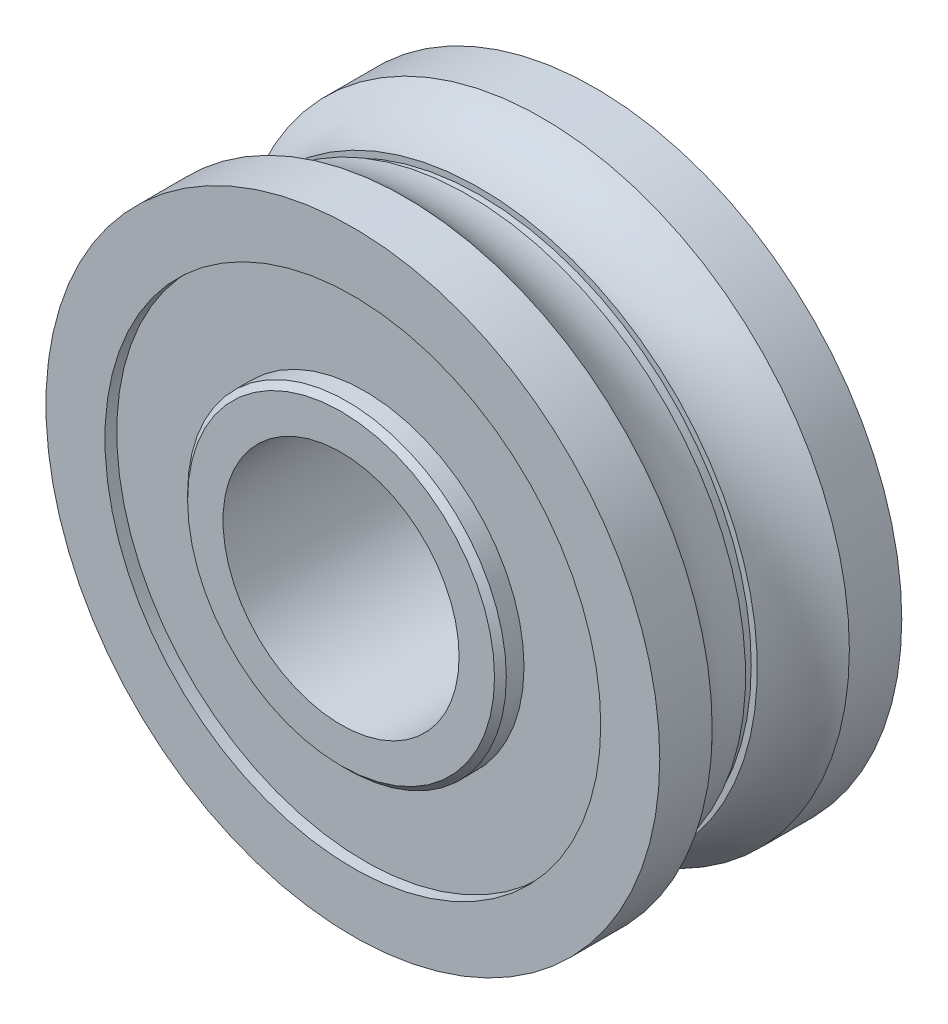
ISO-10303-21;
HEADER;
FILE_DESCRIPTION(('STEP AP214'),'2;1');
FILE_NAME('part.step','',(''),(''),'','','');
FILE_SCHEMA(('AUTOMOTIVE_DESIGN { 1 0 10303 214 1 1 1 1 }'));
ENDSEC;
DATA;
#1=APPLICATION_CONTEXT('core data for automotive mechanical design processes');
#2=APPLICATION_PROTOCOL_DEFINITION('international standard','automotive_design',2000,#1);
#3=PRODUCT_CONTEXT('',#1,'mechanical');
#4=PRODUCT('Part','Part','',(#3));
#5=PRODUCT_RELATED_PRODUCT_CATEGORY('part','',(#4));
#6=PRODUCT_DEFINITION_FORMATION('','',#4);
#7=PRODUCT_DEFINITION_CONTEXT('part definition',#1,'design');
#8=PRODUCT_DEFINITION('design','',#6,#7);
#9=PRODUCT_DEFINITION_SHAPE('','',#8);
#10=(LENGTH_UNIT() NAMED_UNIT(*) SI_UNIT(.MILLI.,.METRE.));
#11=(NAMED_UNIT(*) PLANE_ANGLE_UNIT() SI_UNIT($,.RADIAN.));
#12=(NAMED_UNIT(*) SI_UNIT($,.STERADIAN.) SOLID_ANGLE_UNIT());
#13=UNCERTAINTY_MEASURE_WITH_UNIT(LENGTH_MEASURE(1.E-05),#10,'distance_accuracy_value','');
#14=(GEOMETRIC_REPRESENTATION_CONTEXT(3) GLOBAL_UNCERTAINTY_ASSIGNED_CONTEXT((#13)) GLOBAL_UNIT_ASSIGNED_CONTEXT((#10,
#11,#12)) REPRESENTATION_CONTEXT('',''));
#15=CARTESIAN_POINT('',(0.,0.,0.));
#16=DIRECTION('',(0.,0.,1.));
#17=DIRECTION('',(1.,0.,0.));
#18=AXIS2_PLACEMENT_3D('',#15,#16,#17);
#19=CARTESIAN_POINT('',(-3.410605E-13,0.,-11.75));
#20=DIRECTION('',(0.,0.,1.));
#21=DIRECTION('',(1.,0.,0.));
#22=AXIS2_PLACEMENT_3D('',#19,#20,#21);
#23=CYLINDRICAL_SURFACE('',#22,23.);
#24=CARTESIAN_POINT('',(-3.41060500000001E-13,0.,-11.75));
#25=DIRECTION('',(0.,0.,1.));
#26=DIRECTION('',(1.,0.,0.));
#27=AXIS2_PLACEMENT_3D('',#24,#25,#26);
#28=CIRCLE('',#27,23.);
#29=CARTESIAN_POINT('',(22.9999999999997,0.,-11.7500000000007));
#30=VERTEX_POINT('',#29);
#31=EDGE_CURVE('E69',#30,#30,#28,.F.);
#32=ORIENTED_EDGE('',*,*,#31,.F.);
#33=EDGE_LOOP('',(#32));
#34=FACE_BOUND('',#33,.T.);
#35=CARTESIAN_POINT('',(-3.09656670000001E-13,0.,-10.75));
#36=DIRECTION('',(0.,0.,1.));
#37=DIRECTION('',(1.,0.,0.));
#38=AXIS2_PLACEMENT_3D('',#35,#36,#37);
#39=CIRCLE('',#38,23.);
#40=CARTESIAN_POINT('',(22.9999999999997,0.,-10.7500000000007));
#41=VERTEX_POINT('',#40);
#42=EDGE_CURVE('E16',#41,#41,#39,.F.);
#43=ORIENTED_EDGE('',*,*,#42,.T.);
#44=EDGE_LOOP('',(#43));
#45=FACE_BOUND('',#44,.T.);
#46=ADVANCED_FACE('F13',(#34,#45),#23,.T.);
#47=CARTESIAN_POINT('',(-3.410605E-13,0.,-10.75));
#48=DIRECTION('',(0.,0.,1.));
#49=DIRECTION('',(1.,0.,0.));
#50=AXIS2_PLACEMENT_3D('',#47,#48,#49);
#51=PLANE('',#50);
#52=ORIENTED_EDGE('',*,*,#42,.F.);
#53=EDGE_LOOP('',(#52));
#54=FACE_BOUND('',#53,.T.);
#55=CARTESIAN_POINT('',(-3.25358584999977E-13,0.,-10.7499999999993));
#56=DIRECTION('',(0.,0.,-1.));
#57=DIRECTION('',(-1.,0.,0.));
#58=AXIS2_PLACEMENT_3D('',#55,#56,#57);
#59=CIRCLE('',#58,23.5156402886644);
#60=CARTESIAN_POINT('',(-23.5156402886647,0.,-10.7499999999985));
#61=VERTEX_POINT('',#60);
#62=EDGE_CURVE('E67',#61,#61,#59,.T.);
#63=ORIENTED_EDGE('',*,*,#62,.T.);
#64=EDGE_LOOP('',(#63));
#65=FACE_BOUND('',#64,.T.);
#66=ADVANCED_FACE('F77',(#54,#65),#51,.F.);
#67=CARTESIAN_POINT('',(-3.410605E-13,0.,-11.75));
#68=DIRECTION('',(0.,0.,1.));
#69=DIRECTION('',(1.,0.,0.));
#70=AXIS2_PLACEMENT_3D('',#67,#68,#69);
#71=PLANE('',#70);
#72=ORIENTED_EDGE('',*,*,#31,.T.);
#73=EDGE_LOOP('',(#72));
#74=FACE_BOUND('',#73,.T.);
#75=CARTESIAN_POINT('',(-3.56762414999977E-13,0.,-11.7499999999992));
#76=DIRECTION('',(0.,0.,-1.));
#77=DIRECTION('',(-1.,0.,0.));
#78=AXIS2_PLACEMENT_3D('',#75,#76,#77);
#79=CIRCLE('',#78,23.5156402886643);
#80=CARTESIAN_POINT('',(-23.5156402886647,0.,-11.7499999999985));
#81=VERTEX_POINT('',#80);
#82=EDGE_CURVE('E63',#81,#81,#79,.F.);
#83=ORIENTED_EDGE('',*,*,#82,.T.);
#84=EDGE_LOOP('',(#83));
#85=FACE_BOUND('',#84,.T.);
#86=ADVANCED_FACE('F80',(#74,#85),#71,.T.);
#87=CARTESIAN_POINT('',(-3.410605E-13,0.,-11.25));
#88=DIRECTION('',(0.,0.,-1.));
#89=DIRECTION('',(-1.,0.,0.));
#90=AXIS2_PLACEMENT_3D('',#87,#88,#89);
#91=TOROIDAL_SURFACE('',#90,31.5,8.);
#92=CARTESIAN_POINT('',(-1.77791976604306E-13,0.,-5.44052498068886));
#93=DIRECTION('',(0.,0.,1.));
#94=DIRECTION('',(1.,0.,0.));
#95=AXIS2_PLACEMENT_3D('',#92,#93,#94);
#96=CIRCLE('',#95,26.);
#97=CARTESIAN_POINT('',(25.9999999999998,0.,-5.44052498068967));
#98=VERTEX_POINT('',#97);
#99=EDGE_CURVE('E66',#98,#98,#96,.T.);
#100=ORIENTED_EDGE('',*,*,#99,.F.);
#101=EDGE_LOOP('',(#100));
#102=FACE_BOUND('',#101,.T.);
#103=ORIENTED_EDGE('',*,*,#62,.F.);
#104=EDGE_LOOP('',(#103));
#105=FACE_BOUND('',#104,.T.);
#106=ADVANCED_FACE('F83',(#102,#105),#91,.F.);
#107=CARTESIAN_POINT('',(-3.410605E-13,0.,-11.25));
#108=DIRECTION('',(0.,0.,-1.));
#109=DIRECTION('',(-1.,0.,0.));
#110=AXIS2_PLACEMENT_3D('',#107,#108,#109);
#111=TOROIDAL_SURFACE('',#110,31.5,8.);
#112=ORIENTED_EDGE('',*,*,#82,.F.);
#113=EDGE_LOOP('',(#112));
#114=FACE_BOUND('',#113,.T.);
#115=CARTESIAN_POINT('',(-5.42671508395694E-13,0.,-17.0594750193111));
#116=DIRECTION('',(0.,0.,1.));
#117=DIRECTION('',(1.,0.,0.));
#118=AXIS2_PLACEMENT_3D('',#115,#116,#117);
#119=CIRCLE('',#118,26.);
#120=CARTESIAN_POINT('',(25.9999999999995,0.,-17.0594750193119));
#121=VERTEX_POINT('',#120);
#122=EDGE_CURVE('E62',#121,#121,#119,.F.);
#123=ORIENTED_EDGE('',*,*,#122,.F.);
#124=EDGE_LOOP('',(#123));
#125=FACE_BOUND('',#124,.T.);
#126=ADVANCED_FACE('F85',(#114,#125),#111,.F.);
#127=CARTESIAN_POINT('',(-6.82121E-13,0.,-21.5));
#128=DIRECTION('',(0.,0.,1.));
#129=DIRECTION('',(1.,0.,0.));
#130=AXIS2_PLACEMENT_3D('',#127,#128,#129);
#131=CYLINDRICAL_SURFACE('',#130,26.);
#132=ORIENTED_EDGE('',*,*,#99,.T.);
#133=EDGE_LOOP('',(#132));
#134=FACE_BOUND('',#133,.T.);
#135=CARTESIAN_POINT('',(0.,0.,-0.999999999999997));
#136=DIRECTION('',(0.,0.,1.));
#137=DIRECTION('',(1.,0.,0.));
#138=AXIS2_PLACEMENT_3D('',#135,#136,#137);
#139=CIRCLE('',#138,26.);
#140=CARTESIAN_POINT('',(26.,0.,-1.00000000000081));
#141=VERTEX_POINT('',#140);
#142=EDGE_CURVE('E59',#141,#141,#139,.T.);
#143=ORIENTED_EDGE('',*,*,#142,.F.);
#144=EDGE_LOOP('',(#143));
#145=FACE_BOUND('',#144,.T.);
#146=ADVANCED_FACE('F93',(#134,#145),#131,.T.);
#147=CARTESIAN_POINT('',(-6.82121E-13,0.,-21.5));
#148=DIRECTION('',(0.,0.,1.));
#149=DIRECTION('',(1.,0.,0.));
#150=AXIS2_PLACEMENT_3D('',#147,#148,#149);
#151=CYLINDRICAL_SURFACE('',#150,26.);
#152=ORIENTED_EDGE('',*,*,#122,.T.);
#153=EDGE_LOOP('',(#152));
#154=FACE_BOUND('',#153,.T.);
#155=CARTESIAN_POINT('',(-6.82121E-13,0.,-21.5));
#156=DIRECTION('',(0.,0.,1.));
#157=DIRECTION('',(1.,0.,0.));
#158=AXIS2_PLACEMENT_3D('',#155,#156,#157);
#159=CIRCLE('',#158,26.);
#160=CARTESIAN_POINT('',(25.9999999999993,0.,-21.5000000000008));
#161=VERTEX_POINT('',#160);
#162=EDGE_CURVE('E56',#161,#161,#159,.T.);
#163=ORIENTED_EDGE('',*,*,#162,.T.);
#164=EDGE_LOOP('',(#163));
#165=FACE_BOUND('',#164,.T.);
#166=ADVANCED_FACE('F152',(#154,#165),#151,.T.);
#167=CARTESIAN_POINT('',(0.,0.,-1.));
#168=DIRECTION('',(0.,0.,1.));
#169=DIRECTION('',(1.,0.,0.));
#170=AXIS2_PLACEMENT_3D('',#167,#168,#169);
#171=PLANE('',#170);
#172=CARTESIAN_POINT('',(0.,0.,-0.999999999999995));
#173=DIRECTION('',(0.,0.,1.));
#174=DIRECTION('',(1.,0.,0.));
#175=AXIS2_PLACEMENT_3D('',#172,#173,#174);
#176=CIRCLE('',#175,21.);
#177=CARTESIAN_POINT('',(20.9999999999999,0.,-1.00000000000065));
#178=VERTEX_POINT('',#177);
#179=EDGE_CURVE('E53',#178,#178,#176,.F.);
#180=ORIENTED_EDGE('',*,*,#179,.T.);
#181=EDGE_LOOP('',(#180));
#182=FACE_BOUND('',#181,.T.);
#183=ORIENTED_EDGE('',*,*,#142,.T.);
#184=EDGE_LOOP('',(#183));
#185=FACE_BOUND('',#184,.T.);
#186=ADVANCED_FACE('F148',(#182,#185),#171,.T.);
#187=CARTESIAN_POINT('',(-6.82121E-13,0.,-21.5));
#188=DIRECTION('',(0.,0.,1.));
#189=DIRECTION('',(1.,0.,0.));
#190=AXIS2_PLACEMENT_3D('',#187,#188,#189);
#191=PLANE('',#190);
#192=CARTESIAN_POINT('',(-6.82121E-13,0.,-21.5));
#193=DIRECTION('',(0.,0.,1.));
#194=DIRECTION('',(1.,0.,0.));
#195=AXIS2_PLACEMENT_3D('',#192,#193,#194);
#196=CIRCLE('',#195,21.);
#197=CARTESIAN_POINT('',(20.9999999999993,0.,-21.5000000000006));
#198=VERTEX_POINT('',#197);
#199=EDGE_CURVE('E50',#198,#198,#196,.T.);
#200=ORIENTED_EDGE('',*,*,#199,.T.);
#201=EDGE_LOOP('',(#200));
#202=FACE_BOUND('',#201,.T.);
#203=ORIENTED_EDGE('',*,*,#162,.F.);
#204=EDGE_LOOP('',(#203));
#205=FACE_BOUND('',#204,.T.);
#206=ADVANCED_FACE('F144',(#202,#205),#191,.F.);
#207=CARTESIAN_POINT('',(-1.136868E-13,0.,-1.99999999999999));
#208=DIRECTION('',(0.,0.,1.));
#209=DIRECTION('',(1.,0.,0.));
#210=AXIS2_PLACEMENT_3D('',#207,#208,#209);
#211=CYLINDRICAL_SURFACE('',#210,21.);
#212=CARTESIAN_POINT('',(-1.136868E-13,0.,-1.99999999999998));
#213=DIRECTION('',(0.,0.,1.));
#214=DIRECTION('',(1.,0.,0.));
#215=AXIS2_PLACEMENT_3D('',#212,#213,#214);
#216=CIRCLE('',#215,21.);
#217=CARTESIAN_POINT('',(20.9999999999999,0.,-2.00000000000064));
#218=VERTEX_POINT('',#217);
#219=EDGE_CURVE('E47',#218,#218,#216,.T.);
#220=ORIENTED_EDGE('',*,*,#219,.F.);
#221=EDGE_LOOP('',(#220));
#222=FACE_BOUND('',#221,.T.);
#223=ORIENTED_EDGE('',*,*,#179,.F.);
#224=EDGE_LOOP('',(#223));
#225=FACE_BOUND('',#224,.T.);
#226=ADVANCED_FACE('F140',(#222,#225),#211,.F.);
#227=CARTESIAN_POINT('',(-6.82121E-13,0.,-21.5));
#228=DIRECTION('',(0.,0.,1.));
#229=DIRECTION('',(1.,0.,0.));
#230=AXIS2_PLACEMENT_3D('',#227,#228,#229);
#231=CYLINDRICAL_SURFACE('',#230,21.);
#232=ORIENTED_EDGE('',*,*,#199,.F.);
#233=EDGE_LOOP('',(#232));
#234=FACE_BOUND('',#233,.T.);
#235=CARTESIAN_POINT('',(-6.5071717E-13,0.,-20.5));
#236=DIRECTION('',(0.,0.,1.));
#237=DIRECTION('',(1.,0.,0.));
#238=AXIS2_PLACEMENT_3D('',#235,#236,#237);
#239=CIRCLE('',#238,21.);
#240=CARTESIAN_POINT('',(20.9999999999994,0.,-20.5000000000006));
#241=VERTEX_POINT('',#240);
#242=EDGE_CURVE('E44',#241,#241,#239,.T.);
#243=ORIENTED_EDGE('',*,*,#242,.T.);
#244=EDGE_LOOP('',(#243));
#245=FACE_BOUND('',#244,.T.);
#246=ADVANCED_FACE('F136',(#234,#245),#231,.F.);
#247=CARTESIAN_POINT('',(-1.136868E-13,0.,-1.99999999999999));
#248=DIRECTION('',(0.,0.,1.));
#249=DIRECTION('',(1.,0.,0.));
#250=AXIS2_PLACEMENT_3D('',#247,#248,#249);
#251=PLANE('',#250);
#252=CARTESIAN_POINT('',(0.,0.,-1.99999999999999));
#253=DIRECTION('',(0.,0.,1.));
#254=DIRECTION('',(1.,0.,0.));
#255=AXIS2_PLACEMENT_3D('',#252,#253,#254);
#256=CIRCLE('',#255,13.5);
#257=CARTESIAN_POINT('',(13.5,0.,-2.00000000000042));
#258=VERTEX_POINT('',#257);
#259=EDGE_CURVE('E41',#258,#258,#256,.T.);
#260=ORIENTED_EDGE('',*,*,#259,.F.);
#261=EDGE_LOOP('',(#260));
#262=FACE_BOUND('',#261,.T.);
#263=ORIENTED_EDGE('',*,*,#219,.T.);
#264=EDGE_LOOP('',(#263));
#265=FACE_BOUND('',#264,.T.);
#266=ADVANCED_FACE('F132',(#262,#265),#251,.T.);
#267=CARTESIAN_POINT('',(-6.82121E-13,0.,-20.5));
#268=DIRECTION('',(0.,0.,1.));
#269=DIRECTION('',(1.,0.,0.));
#270=AXIS2_PLACEMENT_3D('',#267,#268,#269);
#271=PLANE('',#270);
#272=CARTESIAN_POINT('',(-6.1931334E-13,0.,-20.5));
#273=DIRECTION('',(0.,0.,1.));
#274=DIRECTION('',(1.,0.,0.));
#275=AXIS2_PLACEMENT_3D('',#272,#273,#274);
#276=CIRCLE('',#275,13.5);
#277=CARTESIAN_POINT('',(13.4999999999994,0.,-20.5000000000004));
#278=VERTEX_POINT('',#277);
#279=EDGE_CURVE('E37',#278,#278,#276,.F.);
#280=ORIENTED_EDGE('',*,*,#279,.F.);
#281=EDGE_LOOP('',(#280));
#282=FACE_BOUND('',#281,.T.);
#283=ORIENTED_EDGE('',*,*,#242,.F.);
#284=EDGE_LOOP('',(#283));
#285=FACE_BOUND('',#284,.T.);
#286=ADVANCED_FACE('F128',(#282,#285),#271,.F.);
#287=CARTESIAN_POINT('',(-6.82121E-13,0.,-22.5));
#288=DIRECTION('',(0.,0.,1.));
#289=DIRECTION('',(1.,0.,0.));
#290=AXIS2_PLACEMENT_3D('',#287,#288,#289);
#291=CYLINDRICAL_SURFACE('',#290,13.5);
#292=CARTESIAN_POINT('',(0.,0.,-0.500000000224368));
#293=DIRECTION('',(0.,0.,-1.));
#294=DIRECTION('',(-1.,0.,0.));
#295=AXIS2_PLACEMENT_3D('',#292,#293,#294);
#296=CIRCLE('',#295,13.4999999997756);
#297=CARTESIAN_POINT('',(-13.4999999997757,0.,-0.500000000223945));
#298=VERTEX_POINT('',#297);
#299=EDGE_CURVE('E40',#298,#298,#296,.F.);
#300=ORIENTED_EDGE('',*,*,#299,.F.);
#301=EDGE_LOOP('',(#300));
#302=FACE_BOUND('',#301,.T.);
#303=ORIENTED_EDGE('',*,*,#259,.T.);
#304=EDGE_LOOP('',(#303));
#305=FACE_BOUND('',#304,.T.);
#306=ADVANCED_FACE('F124',(#302,#305),#291,.T.);
#307=CARTESIAN_POINT('',(-6.82121E-13,0.,-22.5));
#308=DIRECTION('',(0.,0.,1.));
#309=DIRECTION('',(1.,0.,0.));
#310=AXIS2_PLACEMENT_3D('',#307,#308,#309);
#311=CYLINDRICAL_SURFACE('',#310,13.5);
#312=CARTESIAN_POINT('',(-6.74270042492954E-13,0.,-21.9999999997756));
#313=DIRECTION('',(0.,0.,1.));
#314=DIRECTION('',(-1.,0.,0.));
#315=AXIS2_PLACEMENT_3D('',#312,#313,#314);
#316=CIRCLE('',#315,13.4999999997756);
#317=CARTESIAN_POINT('',(-13.4999999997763,0.,-21.9999999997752));
#318=VERTEX_POINT('',#317);
#319=EDGE_CURVE('E36',#318,#318,#316,.F.);
#320=ORIENTED_EDGE('',*,*,#319,.F.);
#321=EDGE_LOOP('',(#320));
#322=FACE_BOUND('',#321,.T.);
#323=ORIENTED_EDGE('',*,*,#279,.T.);
#324=EDGE_LOOP('',(#323));
#325=FACE_BOUND('',#324,.T.);
#326=ADVANCED_FACE('F120',(#322,#325),#311,.T.);
#327=CARTESIAN_POINT('',(0.,0.,-0.500000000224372));
#328=DIRECTION('',(0.,0.,-1.));
#329=DIRECTION('',(-1.,0.,0.));
#330=AXIS2_PLACEMENT_3D('',#327,#328,#329);
#331=CONICAL_SURFACE('',#330,13.4999999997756,0.7853981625);
#332=ORIENTED_EDGE('',*,*,#299,.T.);
#333=EDGE_LOOP('',(#332));
#334=FACE_BOUND('',#333,.T.);
#335=CARTESIAN_POINT('',(0.,0.,2.24355581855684E-10));
#336=DIRECTION('',(0.,0.,-1.));
#337=DIRECTION('',(-1.,0.,0.));
#338=AXIS2_PLACEMENT_3D('',#335,#336,#337);
#339=CIRCLE('',#338,13.0000000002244);
#340=CARTESIAN_POINT('',(-13.0000000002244,0.,2.24763856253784E-10));
#341=VERTEX_POINT('',#340);
#342=EDGE_CURVE('E33',#341,#341,#339,.F.);
#343=ORIENTED_EDGE('',*,*,#342,.F.);
#344=EDGE_LOOP('',(#343));
#345=FACE_BOUND('',#344,.T.);
#346=ADVANCED_FACE('F116',(#334,#345),#331,.T.);
#347=CARTESIAN_POINT('',(-6.74807432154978E-13,0.,-21.9999999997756));
#348=DIRECTION('',(0.,0.,1.));
#349=DIRECTION('',(1.,0.,0.));
#350=AXIS2_PLACEMENT_3D('',#347,#348,#349);
#351=CONICAL_SURFACE('',#350,13.4999999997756,0.785398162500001);
#352=ORIENTED_EDGE('',*,*,#319,.T.);
#353=EDGE_LOOP('',(#352));
#354=FACE_BOUND('',#353,.T.);
#355=CARTESIAN_POINT('',(-6.9041994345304E-13,0.,-22.5000000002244));
#356=DIRECTION('',(0.,0.,1.));
#357=DIRECTION('',(1.,0.,0.));
#358=AXIS2_PLACEMENT_3D('',#355,#356,#357);
#359=CIRCLE('',#358,13.0000000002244);
#360=CARTESIAN_POINT('',(13.0000000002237,0.,-22.5000000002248));
#361=VERTEX_POINT('',#360);
#362=EDGE_CURVE('E25',#361,#361,#359,.T.);
#363=ORIENTED_EDGE('',*,*,#362,.T.);
#364=EDGE_LOOP('',(#363));
#365=FACE_BOUND('',#364,.T.);
#366=ADVANCED_FACE('F112',(#354,#365),#351,.T.);
#367=CARTESIAN_POINT('',(0.,0.,0.));
#368=DIRECTION('',(0.,0.,1.));
#369=DIRECTION('',(1.,0.,0.));
#370=AXIS2_PLACEMENT_3D('',#367,#368,#369);
#371=PLANE('',#370);
#372=CARTESIAN_POINT('',(0.,0.,0.));
#373=DIRECTION('',(0.,0.,1.));
#374=DIRECTION('',(1.,0.,0.));
#375=AXIS2_PLACEMENT_3D('',#372,#373,#374);
#376=CIRCLE('',#375,10.);
#377=CARTESIAN_POINT('',(10.,0.,-3.10568853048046E-13));
#378=VERTEX_POINT('',#377);
#379=EDGE_CURVE('E20',#378,#378,#376,.F.);
#380=ORIENTED_EDGE('',*,*,#379,.T.);
#381=EDGE_LOOP('',(#380));
#382=FACE_BOUND('',#381,.T.);
#383=ORIENTED_EDGE('',*,*,#342,.T.);
#384=EDGE_LOOP('',(#383));
#385=FACE_BOUND('',#384,.T.);
#386=ADVANCED_FACE('F106',(#382,#385),#371,.T.);
#387=CARTESIAN_POINT('',(-6.82121E-13,0.,-22.5));
#388=DIRECTION('',(0.,0.,1.));
#389=DIRECTION('',(1.,0.,0.));
#390=AXIS2_PLACEMENT_3D('',#387,#388,#389);
#391=PLANE('',#390);
#392=CARTESIAN_POINT('',(-6.73965975E-13,0.,-22.5));
#393=DIRECTION('',(0.,0.,1.));
#394=DIRECTION('',(1.,0.,0.));
#395=AXIS2_PLACEMENT_3D('',#392,#393,#394);
#396=CIRCLE('',#395,10.);
#397=CARTESIAN_POINT('',(9.99999999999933,0.,-22.5000000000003));
#398=VERTEX_POINT('',#397);
#399=EDGE_CURVE('E9',#398,#398,#396,.T.);
#400=ORIENTED_EDGE('',*,*,#399,.T.);
#401=EDGE_LOOP('',(#400));
#402=FACE_BOUND('',#401,.T.);
#403=ORIENTED_EDGE('',*,*,#362,.F.);
#404=EDGE_LOOP('',(#403));
#405=FACE_BOUND('',#404,.T.);
#406=ADVANCED_FACE('F100',(#402,#405),#391,.F.);
#407=CARTESIAN_POINT('',(-9.094947E-13,0.,-30.));
#408=DIRECTION('',(0.,0.,1.));
#409=DIRECTION('',(1.,0.,0.));
#410=AXIS2_PLACEMENT_3D('',#407,#408,#409);
#411=CYLINDRICAL_SURFACE('',#410,10.);
#412=ORIENTED_EDGE('',*,*,#399,.F.);
#413=EDGE_LOOP('',(#412));
#414=FACE_BOUND('',#413,.T.);
#415=ORIENTED_EDGE('',*,*,#379,.F.);
#416=EDGE_LOOP('',(#415));
#417=FACE_BOUND('',#416,.T.);
#418=ADVANCED_FACE('F98',(#414,#417),#411,.F.);
#419=CLOSED_SHELL('',(#46,#66,#86,#106,#126,#146,#166,#186,#206,#226,#246,#266,#286,#306,#326,
#346,#366,#386,#406,#418));
#420=MANIFOLD_SOLID_BREP('B1',#419);
#421=ADVANCED_BREP_SHAPE_REPRESENTATION('',(#18,#420),#14);
#422=SHAPE_DEFINITION_REPRESENTATION(#9,#421);
ENDSEC;
END-ISO-10303-21;
